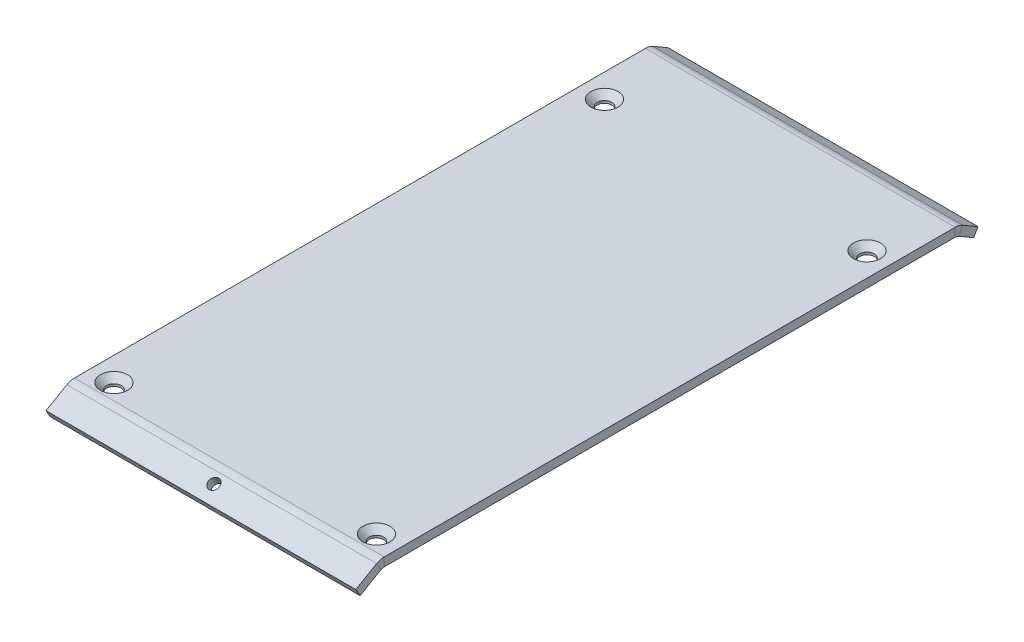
ISO-10303-21;
HEADER;
FILE_DESCRIPTION(('STEP AP214'),'2;1');
FILE_NAME('part.step','',(''),(''),'','','');
FILE_SCHEMA(('AUTOMOTIVE_DESIGN { 1 0 10303 214 1 1 1 1 }'));
ENDSEC;
DATA;
#1=APPLICATION_CONTEXT('core data for automotive mechanical design processes');
#2=APPLICATION_PROTOCOL_DEFINITION('international standard','automotive_design',2000,#1);
#3=PRODUCT_CONTEXT('',#1,'mechanical');
#4=PRODUCT('Part','Part','',(#3));
#5=PRODUCT_RELATED_PRODUCT_CATEGORY('part','',(#4));
#6=PRODUCT_DEFINITION_FORMATION('','',#4);
#7=PRODUCT_DEFINITION_CONTEXT('part definition',#1,'design');
#8=PRODUCT_DEFINITION('design','',#6,#7);
#9=PRODUCT_DEFINITION_SHAPE('','',#8);
#10=(LENGTH_UNIT() NAMED_UNIT(*) SI_UNIT(.MILLI.,.METRE.));
#11=(NAMED_UNIT(*) PLANE_ANGLE_UNIT() SI_UNIT($,.RADIAN.));
#12=(NAMED_UNIT(*) SI_UNIT($,.STERADIAN.) SOLID_ANGLE_UNIT());
#13=UNCERTAINTY_MEASURE_WITH_UNIT(LENGTH_MEASURE(1.E-05),#10,'distance_accuracy_value','');
#14=(GEOMETRIC_REPRESENTATION_CONTEXT(3) GLOBAL_UNCERTAINTY_ASSIGNED_CONTEXT((#13)) GLOBAL_UNIT_ASSIGNED_CONTEXT((#10,
#11,#12)) REPRESENTATION_CONTEXT('',''));
#15=CARTESIAN_POINT('',(0.,0.,0.));
#16=DIRECTION('',(0.,0.,1.));
#17=DIRECTION('',(1.,0.,0.));
#18=AXIS2_PLACEMENT_3D('',#15,#16,#17);
#19=CARTESIAN_POINT('',(36.,2.79903810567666,-4.84807621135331));
#20=DIRECTION('',(1.,0.,0.));
#21=DIRECTION('',(0.,0.,-1.));
#22=AXIS2_PLACEMENT_3D('',#19,#20,#21);
#23=PLANE('',#22);
#24=DIRECTION('',(0.,0.866025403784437,0.500000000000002));
#25=VECTOR('',#24,1.);
#26=CARTESIAN_POINT('',(36.,2.79903810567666,-4.84807621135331));
#27=LINE('',#26,#25);
#28=CARTESIAN_POINT('',(36.,2.79903810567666,-4.84807621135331));
#29=VERTEX_POINT('',#28);
#30=CARTESIAN_POINT('',(36.,4.53108891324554,-3.8480762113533));
#31=VERTEX_POINT('',#30);
#32=EDGE_CURVE('E11',#29,#31,#27,.T.);
#33=ORIENTED_EDGE('',*,*,#32,.F.);
#34=CARTESIAN_POINT('',(36.,1.50000000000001,-5.59807621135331));
#35=DIRECTION('',(1.,0.,0.));
#36=DIRECTION('',(0.,0.,-1.));
#37=AXIS2_PLACEMENT_3D('',#34,#35,#36);
#38=CIRCLE('',#37,1.5);
#39=CARTESIAN_POINT('',(36.,3.00000000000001,-5.59807621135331));
#40=VERTEX_POINT('',#39);
#41=EDGE_CURVE('E147',#29,#40,#38,.F.);
#42=ORIENTED_EDGE('',*,*,#41,.T.);
#43=DIRECTION('',(0.,-1.,0.));
#44=VECTOR('',#43,1.);
#45=CARTESIAN_POINT('',(36.,5.00000000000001,-5.59807621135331));
#46=LINE('',#45,#44);
#47=CARTESIAN_POINT('',(36.,5.00000000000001,-5.59807621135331));
#48=VERTEX_POINT('',#47);
#49=EDGE_CURVE('E43',#48,#40,#46,.T.);
#50=ORIENTED_EDGE('',*,*,#49,.F.);
#51=CARTESIAN_POINT('',(36.,1.50000000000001,-5.59807621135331));
#52=DIRECTION('',(1.,0.,0.));
#53=DIRECTION('',(0.,0.,-1.));
#54=AXIS2_PLACEMENT_3D('',#51,#52,#53);
#55=CIRCLE('',#54,3.5);
#56=EDGE_CURVE('E286',#31,#48,#55,.F.);
#57=ORIENTED_EDGE('',*,*,#56,.F.);
#58=EDGE_LOOP('',(#33,#42,#50,#57));
#59=FACE_BOUND('',#58,.T.);
#60=ADVANCED_FACE('F34',(#59),#23,.T.);
#61=CARTESIAN_POINT('',(36.,5.00000000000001,-5.59807621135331));
#62=DIRECTION('',(1.,0.,0.));
#63=DIRECTION('',(0.,0.,-1.));
#64=AXIS2_PLACEMENT_3D('',#61,#62,#63);
#65=PLANE('',#64);
#66=DIRECTION('',(0.,0.500000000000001,-0.866025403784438));
#67=VECTOR('',#66,1.);
#68=CARTESIAN_POINT('',(36.,0.,0.));
#69=LINE('',#68,#67);
#70=CARTESIAN_POINT('',(36.,0.,0.));
#71=VERTEX_POINT('',#70);
#72=EDGE_CURVE('E152',#71,#29,#69,.T.);
#73=ORIENTED_EDGE('',*,*,#72,.T.);
#74=ORIENTED_EDGE('',*,*,#32,.T.);
#75=DIRECTION('',(0.,0.500000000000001,-0.866025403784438));
#76=VECTOR('',#75,1.);
#77=CARTESIAN_POINT('',(36.,1.73205080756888,1.));
#78=LINE('',#77,#76);
#79=CARTESIAN_POINT('',(36.,1.73205080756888,1.));
#80=VERTEX_POINT('',#79);
#81=EDGE_CURVE('E288',#80,#31,#78,.T.);
#82=ORIENTED_EDGE('',*,*,#81,.F.);
#83=DIRECTION('',(0.,0.866025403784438,0.500000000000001));
#84=VECTOR('',#83,1.);
#85=CARTESIAN_POINT('',(36.,0.,0.));
#86=LINE('',#85,#84);
#87=EDGE_CURVE('E291',#71,#80,#86,.T.);
#88=ORIENTED_EDGE('',*,*,#87,.F.);
#89=EDGE_LOOP('',(#73,#74,#82,#88));
#90=FACE_BOUND('',#89,.T.);
#91=ADVANCED_FACE('F297',(#90),#65,.T.);
#92=CARTESIAN_POINT('',(-36.,3.00000000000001,-5.59807621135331));
#93=DIRECTION('',(-1.,0.,0.));
#94=DIRECTION('',(0.,0.,1.));
#95=AXIS2_PLACEMENT_3D('',#92,#93,#94);
#96=PLANE('',#95);
#97=DIRECTION('',(0.,1.,0.));
#98=VECTOR('',#97,1.);
#99=CARTESIAN_POINT('',(-36.,3.00000000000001,-5.59807621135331));
#100=LINE('',#99,#98);
#101=CARTESIAN_POINT('',(-36.,3.00000000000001,-5.59807621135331));
#102=VERTEX_POINT('',#101);
#103=CARTESIAN_POINT('',(-36.,5.00000000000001,-5.59807621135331));
#104=VERTEX_POINT('',#103);
#105=EDGE_CURVE('E144',#102,#104,#100,.T.);
#106=ORIENTED_EDGE('',*,*,#105,.F.);
#107=CARTESIAN_POINT('',(-36.,1.50000000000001,-5.59807621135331));
#108=DIRECTION('',(1.,0.,0.));
#109=DIRECTION('',(0.,0.,-1.));
#110=AXIS2_PLACEMENT_3D('',#107,#108,#109);
#111=CIRCLE('',#110,1.5);
#112=CARTESIAN_POINT('',(-36.,2.79903810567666,-4.84807621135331));
#113=VERTEX_POINT('',#112);
#114=EDGE_CURVE('E159',#113,#102,#111,.F.);
#115=ORIENTED_EDGE('',*,*,#114,.F.);
#116=DIRECTION('',(0.,-0.866025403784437,-0.500000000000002));
#117=VECTOR('',#116,1.);
#118=CARTESIAN_POINT('',(-36.,4.53108891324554,-3.8480762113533));
#119=LINE('',#118,#117);
#120=CARTESIAN_POINT('',(-36.,4.53108891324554,-3.8480762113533));
#121=VERTEX_POINT('',#120);
#122=EDGE_CURVE('E233',#121,#113,#119,.T.);
#123=ORIENTED_EDGE('',*,*,#122,.F.);
#124=CARTESIAN_POINT('',(-36.,1.50000000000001,-5.59807621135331));
#125=DIRECTION('',(1.,0.,0.));
#126=DIRECTION('',(0.,0.,-1.));
#127=AXIS2_PLACEMENT_3D('',#124,#125,#126);
#128=CIRCLE('',#127,3.5);
#129=EDGE_CURVE('E187',#121,#104,#128,.F.);
#130=ORIENTED_EDGE('',*,*,#129,.T.);
#131=EDGE_LOOP('',(#106,#115,#123,#130));
#132=FACE_BOUND('',#131,.T.);
#133=ADVANCED_FACE('F304',(#132),#96,.T.);
#134=CARTESIAN_POINT('',(-36.,4.53108891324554,-3.8480762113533));
#135=DIRECTION('',(-1.,0.,0.));
#136=DIRECTION('',(0.,0.,1.));
#137=AXIS2_PLACEMENT_3D('',#134,#135,#136);
#138=PLANE('',#137);
#139=DIRECTION('',(0.,0.,-1.));
#140=VECTOR('',#139,1.);
#141=CARTESIAN_POINT('',(-36.,3.00000000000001,-5.19615242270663));
#142=LINE('',#141,#140);
#143=CARTESIAN_POINT('',(-36.,3.00000000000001,-138.29422863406));
#144=VERTEX_POINT('',#143);
#145=EDGE_CURVE('E200',#102,#144,#142,.T.);
#146=ORIENTED_EDGE('',*,*,#145,.F.);
#147=ORIENTED_EDGE('',*,*,#105,.T.);
#148=DIRECTION('',(0.,0.,-1.));
#149=VECTOR('',#148,1.);
#150=CARTESIAN_POINT('',(-36.,5.00000000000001,-5.19615242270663));
#151=LINE('',#150,#149);
#152=CARTESIAN_POINT('',(-36.,5.00000000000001,-138.29422863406));
#153=VERTEX_POINT('',#152);
#154=EDGE_CURVE('E185',#104,#153,#151,.T.);
#155=ORIENTED_EDGE('',*,*,#154,.T.);
#156=DIRECTION('',(0.,-1.,0.));
#157=VECTOR('',#156,1.);
#158=CARTESIAN_POINT('',(-36.,5.00000000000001,-138.29422863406));
#159=LINE('',#158,#157);
#160=EDGE_CURVE('E93',#153,#144,#159,.T.);
#161=ORIENTED_EDGE('',*,*,#160,.T.);
#162=EDGE_LOOP('',(#146,#147,#155,#161));
#163=FACE_BOUND('',#162,.T.);
#164=ADVANCED_FACE('F306',(#163),#138,.T.);
#165=CARTESIAN_POINT('',(36.,3.00000000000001,-138.29422863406));
#166=DIRECTION('',(1.,0.,0.));
#167=DIRECTION('',(0.,0.,-1.));
#168=AXIS2_PLACEMENT_3D('',#165,#166,#167);
#169=PLANE('',#168);
#170=DIRECTION('',(0.,1.,0.));
#171=VECTOR('',#170,1.);
#172=CARTESIAN_POINT('',(36.,3.00000000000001,-138.29422863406));
#173=LINE('',#172,#171);
#174=CARTESIAN_POINT('',(36.,3.00000000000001,-138.29422863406));
#175=VERTEX_POINT('',#174);
#176=CARTESIAN_POINT('',(36.,5.00000000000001,-138.29422863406));
#177=VERTEX_POINT('',#176);
#178=EDGE_CURVE('E231',#175,#177,#173,.T.);
#179=ORIENTED_EDGE('',*,*,#178,.F.);
#180=CARTESIAN_POINT('',(36.,1.50000000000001,-138.29422863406));
#181=DIRECTION('',(1.,0.,0.));
#182=DIRECTION('',(0.,0.,-1.));
#183=AXIS2_PLACEMENT_3D('',#180,#181,#182);
#184=CIRCLE('',#183,1.5);
#185=CARTESIAN_POINT('',(36.,2.79903810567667,-139.04422863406));
#186=VERTEX_POINT('',#185);
#187=EDGE_CURVE('E167',#175,#186,#184,.F.);
#188=ORIENTED_EDGE('',*,*,#187,.T.);
#189=DIRECTION('',(0.,-0.866025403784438,0.500000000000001));
#190=VECTOR('',#189,1.);
#191=CARTESIAN_POINT('',(36.,4.53108891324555,-140.04422863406));
#192=LINE('',#191,#190);
#193=CARTESIAN_POINT('',(36.,4.53108891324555,-140.04422863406));
#194=VERTEX_POINT('',#193);
#195=EDGE_CURVE('E52',#194,#186,#192,.T.);
#196=ORIENTED_EDGE('',*,*,#195,.F.);
#197=CARTESIAN_POINT('',(36.,1.50000000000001,-138.29422863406));
#198=DIRECTION('',(1.,0.,0.));
#199=DIRECTION('',(0.,0.,-1.));
#200=AXIS2_PLACEMENT_3D('',#197,#198,#199);
#201=CIRCLE('',#200,3.5);
#202=EDGE_CURVE('E282',#177,#194,#201,.F.);
#203=ORIENTED_EDGE('',*,*,#202,.F.);
#204=EDGE_LOOP('',(#179,#188,#196,#203));
#205=FACE_BOUND('',#204,.T.);
#206=ADVANCED_FACE('F353',(#205),#169,.T.);
#207=CARTESIAN_POINT('',(36.,4.53108891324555,-140.04422863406));
#208=DIRECTION('',(1.,0.,0.));
#209=DIRECTION('',(0.,0.,-1.));
#210=AXIS2_PLACEMENT_3D('',#207,#208,#209);
#211=PLANE('',#210);
#212=DIRECTION('',(0.,0.,-1.));
#213=VECTOR('',#212,1.);
#214=CARTESIAN_POINT('',(36.,3.00000000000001,-5.19615242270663));
#215=LINE('',#214,#213);
#216=EDGE_CURVE('E136',#40,#175,#215,.T.);
#217=ORIENTED_EDGE('',*,*,#216,.T.);
#218=ORIENTED_EDGE('',*,*,#178,.T.);
#219=DIRECTION('',(0.,0.,-1.));
#220=VECTOR('',#219,1.);
#221=CARTESIAN_POINT('',(36.,5.00000000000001,-5.19615242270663));
#222=LINE('',#221,#220);
#223=EDGE_CURVE('E139',#48,#177,#222,.T.);
#224=ORIENTED_EDGE('',*,*,#223,.F.);
#225=ORIENTED_EDGE('',*,*,#49,.T.);
#226=EDGE_LOOP('',(#217,#218,#224,#225));
#227=FACE_BOUND('',#226,.T.);
#228=ADVANCED_FACE('F134',(#227),#211,.T.);
#229=CARTESIAN_POINT('',(-36.,2.79903810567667,-139.04422863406));
#230=DIRECTION('',(-1.,0.,0.));
#231=DIRECTION('',(0.,0.,1.));
#232=AXIS2_PLACEMENT_3D('',#229,#230,#231);
#233=PLANE('',#232);
#234=DIRECTION('',(0.,0.866025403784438,-0.500000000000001));
#235=VECTOR('',#234,1.);
#236=CARTESIAN_POINT('',(-36.,2.79903810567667,-139.04422863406));
#237=LINE('',#236,#235);
#238=CARTESIAN_POINT('',(-36.,2.79903810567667,-139.04422863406));
#239=VERTEX_POINT('',#238);
#240=CARTESIAN_POINT('',(-36.,4.53108891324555,-140.04422863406));
#241=VERTEX_POINT('',#240);
#242=EDGE_CURVE('E100',#239,#241,#237,.T.);
#243=ORIENTED_EDGE('',*,*,#242,.F.);
#244=CARTESIAN_POINT('',(-36.,1.50000000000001,-138.29422863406));
#245=DIRECTION('',(1.,0.,0.));
#246=DIRECTION('',(0.,0.,-1.));
#247=AXIS2_PLACEMENT_3D('',#244,#245,#246);
#248=CIRCLE('',#247,1.5);
#249=EDGE_CURVE('E202',#144,#239,#248,.F.);
#250=ORIENTED_EDGE('',*,*,#249,.F.);
#251=ORIENTED_EDGE('',*,*,#160,.F.);
#252=CARTESIAN_POINT('',(-36.,1.50000000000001,-138.29422863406));
#253=DIRECTION('',(1.,0.,0.));
#254=DIRECTION('',(0.,0.,-1.));
#255=AXIS2_PLACEMENT_3D('',#252,#253,#254);
#256=CIRCLE('',#255,3.5);
#257=EDGE_CURVE('E183',#153,#241,#256,.F.);
#258=ORIENTED_EDGE('',*,*,#257,.T.);
#259=EDGE_LOOP('',(#243,#250,#251,#258));
#260=FACE_BOUND('',#259,.T.);
#261=ADVANCED_FACE('F319',(#260),#233,.T.);
#262=CARTESIAN_POINT('',(-36.,5.00000000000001,-138.29422863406));
#263=DIRECTION('',(-1.,0.,0.));
#264=DIRECTION('',(0.,0.,1.));
#265=AXIS2_PLACEMENT_3D('',#262,#263,#264);
#266=PLANE('',#265);
#267=DIRECTION('',(0.,-0.500000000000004,-0.866025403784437));
#268=VECTOR('',#267,1.);
#269=CARTESIAN_POINT('',(-36.,3.00000000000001,-138.696152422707));
#270=LINE('',#269,#268);
#271=CARTESIAN_POINT('',(-36.,0.749999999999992,-142.593266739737));
#272=VERTEX_POINT('',#271);
#273=EDGE_CURVE('E173',#239,#272,#270,.T.);
#274=ORIENTED_EDGE('',*,*,#273,.F.);
#275=ORIENTED_EDGE('',*,*,#242,.T.);
#276=DIRECTION('',(0.,-0.500000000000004,-0.866025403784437));
#277=VECTOR('',#276,1.);
#278=CARTESIAN_POINT('',(-36.,4.73205080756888,-139.696152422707));
#279=LINE('',#278,#277);
#280=CARTESIAN_POINT('',(-36.,2.48205080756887,-143.593266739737));
#281=VERTEX_POINT('',#280);
#282=EDGE_CURVE('E180',#241,#281,#279,.T.);
#283=ORIENTED_EDGE('',*,*,#282,.T.);
#284=DIRECTION('',(0.,-0.866025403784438,0.500000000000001));
#285=VECTOR('',#284,1.);
#286=CARTESIAN_POINT('',(-36.,2.48205080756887,-143.593266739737));
#287=LINE('',#286,#285);
#288=EDGE_CURVE('E176',#281,#272,#287,.T.);
#289=ORIENTED_EDGE('',*,*,#288,.T.);
#290=EDGE_LOOP('',(#274,#275,#283,#289));
#291=FACE_BOUND('',#290,.T.);
#292=ADVANCED_FACE('F327',(#291),#266,.T.);
#293=CARTESIAN_POINT('',(36.,3.00000000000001,-138.696152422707));
#294=DIRECTION('',(0.,0.866025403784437,-0.500000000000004));
#295=DIRECTION('',(0.,0.500000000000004,0.866025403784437));
#296=AXIS2_PLACEMENT_3D('',#293,#294,#295);
#297=PLANE('',#296);
#298=ORIENTED_EDGE('',*,*,#273,.T.);
#299=DIRECTION('',(-1.,0.,0.));
#300=VECTOR('',#299,1.);
#301=CARTESIAN_POINT('',(36.,0.749999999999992,-142.593266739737));
#302=LINE('',#301,#300);
#303=CARTESIAN_POINT('',(36.,0.749999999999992,-142.593266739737));
#304=VERTEX_POINT('',#303);
#305=EDGE_CURVE('E226',#304,#272,#302,.T.);
#306=ORIENTED_EDGE('',*,*,#305,.F.);
#307=DIRECTION('',(0.,-0.500000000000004,-0.866025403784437));
#308=VECTOR('',#307,1.);
#309=CARTESIAN_POINT('',(36.,3.00000000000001,-138.696152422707));
#310=LINE('',#309,#308);
#311=EDGE_CURVE('E106',#186,#304,#310,.T.);
#312=ORIENTED_EDGE('',*,*,#311,.F.);
#313=DIRECTION('',(-1.,0.,0.));
#314=VECTOR('',#313,1.);
#315=CARTESIAN_POINT('',(36.,2.79903810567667,-139.04422863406));
#316=LINE('',#315,#314);
#317=EDGE_CURVE('E169',#186,#239,#316,.T.);
#318=ORIENTED_EDGE('',*,*,#317,.T.);
#319=EDGE_LOOP('',(#298,#306,#312,#318));
#320=FACE_BOUND('',#319,.T.);
#321=ADVANCED_FACE('F325',(#320),#297,.F.);
#322=CARTESIAN_POINT('',(36.,2.48205080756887,-143.593266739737));
#323=DIRECTION('',(0.,-0.500000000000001,-0.866025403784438));
#324=DIRECTION('',(0.,0.866025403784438,-0.500000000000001));
#325=AXIS2_PLACEMENT_3D('',#322,#323,#324);
#326=PLANE('',#325);
#327=ORIENTED_EDGE('',*,*,#288,.F.);
#328=DIRECTION('',(-1.,0.,0.));
#329=VECTOR('',#328,1.);
#330=CARTESIAN_POINT('',(36.,2.48205080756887,-143.593266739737));
#331=LINE('',#330,#329);
#332=CARTESIAN_POINT('',(36.,2.48205080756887,-143.593266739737));
#333=VERTEX_POINT('',#332);
#334=EDGE_CURVE('E224',#333,#281,#331,.T.);
#335=ORIENTED_EDGE('',*,*,#334,.F.);
#336=DIRECTION('',(0.,-0.866025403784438,0.500000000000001));
#337=VECTOR('',#336,1.);
#338=CARTESIAN_POINT('',(36.,2.48205080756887,-143.593266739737));
#339=LINE('',#338,#337);
#340=EDGE_CURVE('E276',#333,#304,#339,.T.);
#341=ORIENTED_EDGE('',*,*,#340,.T.);
#342=ORIENTED_EDGE('',*,*,#305,.T.);
#343=EDGE_LOOP('',(#327,#335,#341,#342));
#344=FACE_BOUND('',#343,.T.);
#345=ADVANCED_FACE('F330',(#344),#326,.T.);
#346=CARTESIAN_POINT('',(36.,4.73205080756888,-139.696152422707));
#347=DIRECTION('',(0.,0.866025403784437,-0.500000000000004));
#348=DIRECTION('',(0.,0.500000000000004,0.866025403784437));
#349=AXIS2_PLACEMENT_3D('',#346,#347,#348);
#350=PLANE('',#349);
#351=ORIENTED_EDGE('',*,*,#282,.F.);
#352=DIRECTION('',(-1.,0.,0.));
#353=VECTOR('',#352,1.);
#354=CARTESIAN_POINT('',(36.,4.53108891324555,-140.04422863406));
#355=LINE('',#354,#353);
#356=EDGE_CURVE('E221',#194,#241,#355,.T.);
#357=ORIENTED_EDGE('',*,*,#356,.F.);
#358=DIRECTION('',(0.,-0.500000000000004,-0.866025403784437));
#359=VECTOR('',#358,1.);
#360=CARTESIAN_POINT('',(36.,4.73205080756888,-139.696152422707));
#361=LINE('',#360,#359);
#362=EDGE_CURVE('E279',#194,#333,#361,.T.);
#363=ORIENTED_EDGE('',*,*,#362,.T.);
#364=ORIENTED_EDGE('',*,*,#334,.T.);
#365=EDGE_LOOP('',(#351,#357,#363,#364));
#366=FACE_BOUND('',#365,.T.);
#367=ADVANCED_FACE('F333',(#366),#350,.T.);
#368=CARTESIAN_POINT('',(36.,1.50000000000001,-138.29422863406));
#369=DIRECTION('',(-1.,0.,0.));
#370=DIRECTION('',(0.,0.,1.));
#371=AXIS2_PLACEMENT_3D('',#368,#369,#370);
#372=CYLINDRICAL_SURFACE('',#371,3.5);
#373=ORIENTED_EDGE('',*,*,#257,.F.);
#374=DIRECTION('',(-1.,0.,0.));
#375=VECTOR('',#374,1.);
#376=CARTESIAN_POINT('',(36.,5.00000000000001,-138.29422863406));
#377=LINE('',#376,#375);
#378=EDGE_CURVE('E218',#177,#153,#377,.T.);
#379=ORIENTED_EDGE('',*,*,#378,.F.);
#380=ORIENTED_EDGE('',*,*,#202,.T.);
#381=ORIENTED_EDGE('',*,*,#356,.T.);
#382=EDGE_LOOP('',(#373,#379,#380,#381));
#383=FACE_BOUND('',#382,.T.);
#384=ADVANCED_FACE('F316',(#383),#372,.T.);
#385=CARTESIAN_POINT('',(36.,5.00000000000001,-5.19615242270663));
#386=DIRECTION('',(0.,1.,0.));
#387=DIRECTION('',(0.,0.,1.));
#388=AXIS2_PLACEMENT_3D('',#385,#386,#387);
#389=PLANE('',#388);
#390=CARTESIAN_POINT('',(30.5,5.00000000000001,-9.29422863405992));
#391=DIRECTION('',(0.,1.,0.));
#392=DIRECTION('',(0.,0.,1.));
#393=AXIS2_PLACEMENT_3D('',#390,#391,#392);
#394=CIRCLE('',#393,3.15);
#395=CARTESIAN_POINT('',(30.5,5.00000000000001,-6.14422863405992));
#396=VERTEX_POINT('',#395);
#397=EDGE_CURVE('E257',#396,#396,#394,.T.);
#398=ORIENTED_EDGE('',*,*,#397,.F.);
#399=EDGE_LOOP('',(#398));
#400=FACE_BOUND('',#399,.T.);
#401=CARTESIAN_POINT('',(30.5,5.00000000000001,-123.29422863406));
#402=DIRECTION('',(0.,1.,0.));
#403=DIRECTION('',(0.,0.,1.));
#404=AXIS2_PLACEMENT_3D('',#401,#402,#403);
#405=CIRCLE('',#404,3.15);
#406=CARTESIAN_POINT('',(30.5,5.00000000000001,-120.14422863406));
#407=VERTEX_POINT('',#406);
#408=EDGE_CURVE('E250',#407,#407,#405,.T.);
#409=ORIENTED_EDGE('',*,*,#408,.F.);
#410=EDGE_LOOP('',(#409));
#411=FACE_BOUND('',#410,.T.);
#412=CARTESIAN_POINT('',(-30.5,5.00000000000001,-123.29422863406));
#413=DIRECTION('',(0.,1.,0.));
#414=DIRECTION('',(0.,0.,1.));
#415=AXIS2_PLACEMENT_3D('',#412,#413,#414);
#416=CIRCLE('',#415,3.15);
#417=CARTESIAN_POINT('',(-30.5,5.00000000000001,-120.14422863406));
#418=VERTEX_POINT('',#417);
#419=EDGE_CURVE('E246',#418,#418,#416,.T.);
#420=ORIENTED_EDGE('',*,*,#419,.F.);
#421=EDGE_LOOP('',(#420));
#422=FACE_BOUND('',#421,.T.);
#423=CARTESIAN_POINT('',(-30.5,5.00000000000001,-9.29422863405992));
#424=DIRECTION('',(0.,1.,0.));
#425=DIRECTION('',(0.,0.,1.));
#426=AXIS2_PLACEMENT_3D('',#423,#424,#425);
#427=CIRCLE('',#426,3.15);
#428=CARTESIAN_POINT('',(-30.5,5.00000000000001,-6.14422863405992));
#429=VERTEX_POINT('',#428);
#430=EDGE_CURVE('E242',#429,#429,#427,.T.);
#431=ORIENTED_EDGE('',*,*,#430,.F.);
#432=EDGE_LOOP('',(#431));
#433=FACE_BOUND('',#432,.T.);
#434=ORIENTED_EDGE('',*,*,#154,.F.);
#435=DIRECTION('',(-1.,0.,0.));
#436=VECTOR('',#435,1.);
#437=CARTESIAN_POINT('',(36.,5.00000000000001,-5.59807621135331));
#438=LINE('',#437,#436);
#439=EDGE_CURVE('E215',#48,#104,#438,.T.);
#440=ORIENTED_EDGE('',*,*,#439,.F.);
#441=ORIENTED_EDGE('',*,*,#223,.T.);
#442=ORIENTED_EDGE('',*,*,#378,.T.);
#443=EDGE_LOOP('',(#434,#440,#441,#442));
#444=FACE_BOUND('',#443,.T.);
#445=ADVANCED_FACE('F311',(#400,#411,#422,#433,#444),#389,.T.);
#446=CARTESIAN_POINT('',(36.,1.50000000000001,-5.59807621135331));
#447=DIRECTION('',(-1.,0.,0.));
#448=DIRECTION('',(0.,0.,1.));
#449=AXIS2_PLACEMENT_3D('',#446,#447,#448);
#450=CYLINDRICAL_SURFACE('',#449,3.5);
#451=ORIENTED_EDGE('',*,*,#129,.F.);
#452=DIRECTION('',(-1.,0.,0.));
#453=VECTOR('',#452,1.);
#454=CARTESIAN_POINT('',(36.,4.53108891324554,-3.8480762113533));
#455=LINE('',#454,#453);
#456=EDGE_CURVE('E212',#31,#121,#455,.T.);
#457=ORIENTED_EDGE('',*,*,#456,.F.);
#458=ORIENTED_EDGE('',*,*,#56,.T.);
#459=ORIENTED_EDGE('',*,*,#439,.T.);
#460=EDGE_LOOP('',(#451,#457,#458,#459));
#461=FACE_BOUND('',#460,.T.);
#462=ADVANCED_FACE('F309',(#461),#450,.T.);
#463=CARTESIAN_POINT('',(36.,1.73205080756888,1.));
#464=DIRECTION('',(0.,0.866025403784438,0.500000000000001));
#465=DIRECTION('',(0.,-0.500000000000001,0.866025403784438));
#466=AXIS2_PLACEMENT_3D('',#463,#464,#465);
#467=PLANE('',#466);
#468=CARTESIAN_POINT('',(0.,3.48205080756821,-2.03108891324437));
#469=DIRECTION('',(0.,0.866025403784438,0.500000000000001));
#470=DIRECTION('',(0.,-0.500000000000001,0.866025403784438));
#471=AXIS2_PLACEMENT_3D('',#468,#469,#470);
#472=CIRCLE('',#471,1.24999999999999);
#473=CARTESIAN_POINT('',(0.,2.85705080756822,-0.948557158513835));
#474=VERTEX_POINT('',#473);
#475=EDGE_CURVE('E579',#474,#474,#472,.T.);
#476=ORIENTED_EDGE('',*,*,#475,.F.);
#477=EDGE_LOOP('',(#476));
#478=FACE_BOUND('',#477,.T.);
#479=DIRECTION('',(0.,0.500000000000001,-0.866025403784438));
#480=VECTOR('',#479,1.);
#481=CARTESIAN_POINT('',(-36.,1.73205080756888,1.));
#482=LINE('',#481,#480);
#483=CARTESIAN_POINT('',(-36.,1.73205080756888,1.));
#484=VERTEX_POINT('',#483);
#485=EDGE_CURVE('E190',#484,#121,#482,.T.);
#486=ORIENTED_EDGE('',*,*,#485,.F.);
#487=DIRECTION('',(-1.,0.,0.));
#488=VECTOR('',#487,1.);
#489=CARTESIAN_POINT('',(36.,1.73205080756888,1.));
#490=LINE('',#489,#488);
#491=EDGE_CURVE('E210',#80,#484,#490,.T.);
#492=ORIENTED_EDGE('',*,*,#491,.F.);
#493=ORIENTED_EDGE('',*,*,#81,.T.);
#494=ORIENTED_EDGE('',*,*,#456,.T.);
#495=EDGE_LOOP('',(#486,#492,#493,#494));
#496=FACE_BOUND('',#495,.T.);
#497=ADVANCED_FACE('F396',(#478,#496),#467,.T.);
#498=CARTESIAN_POINT('',(36.,0.,0.));
#499=DIRECTION('',(0.,-0.500000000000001,0.866025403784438));
#500=DIRECTION('',(0.,-0.866025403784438,-0.500000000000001));
#501=AXIS2_PLACEMENT_3D('',#498,#499,#500);
#502=PLANE('',#501);
#503=DIRECTION('',(0.,0.866025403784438,0.500000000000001));
#504=VECTOR('',#503,1.);
#505=CARTESIAN_POINT('',(-36.,0.,0.));
#506=LINE('',#505,#504);
#507=CARTESIAN_POINT('',(-36.,0.,0.));
#508=VERTEX_POINT('',#507);
#509=EDGE_CURVE('E193',#508,#484,#506,.T.);
#510=ORIENTED_EDGE('',*,*,#509,.F.);
#511=DIRECTION('',(-1.,0.,0.));
#512=VECTOR('',#511,1.);
#513=CARTESIAN_POINT('',(36.,0.,0.));
#514=LINE('',#513,#512);
#515=EDGE_CURVE('E208',#71,#508,#514,.T.);
#516=ORIENTED_EDGE('',*,*,#515,.F.);
#517=ORIENTED_EDGE('',*,*,#87,.T.);
#518=ORIENTED_EDGE('',*,*,#491,.T.);
#519=EDGE_LOOP('',(#510,#516,#517,#518));
#520=FACE_BOUND('',#519,.T.);
#521=ADVANCED_FACE('F404',(#520),#502,.T.);
#522=CARTESIAN_POINT('',(36.,0.,0.));
#523=DIRECTION('',(0.,0.866025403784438,0.500000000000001));
#524=DIRECTION('',(0.,-0.500000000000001,0.866025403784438));
#525=AXIS2_PLACEMENT_3D('',#522,#523,#524);
#526=PLANE('',#525);
#527=CARTESIAN_POINT('',(0.,1.74999999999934,-3.03108891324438));
#528=DIRECTION('',(0.,0.866025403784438,0.500000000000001));
#529=DIRECTION('',(0.,-0.500000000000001,0.866025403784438));
#530=AXIS2_PLACEMENT_3D('',#527,#528,#529);
#531=CIRCLE('',#530,1.24999999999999);
#532=CARTESIAN_POINT('',(0.,1.12499999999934,-1.94855715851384));
#533=VERTEX_POINT('',#532);
#534=EDGE_CURVE('E37',#533,#533,#531,.T.);
#535=ORIENTED_EDGE('',*,*,#534,.T.);
#536=EDGE_LOOP('',(#535));
#537=FACE_BOUND('',#536,.T.);
#538=DIRECTION('',(0.,0.500000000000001,-0.866025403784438));
#539=VECTOR('',#538,1.);
#540=CARTESIAN_POINT('',(-36.,0.,0.));
#541=LINE('',#540,#539);
#542=EDGE_CURVE('E196',#508,#113,#541,.T.);
#543=ORIENTED_EDGE('',*,*,#542,.T.);
#544=DIRECTION('',(-1.,0.,0.));
#545=VECTOR('',#544,1.);
#546=CARTESIAN_POINT('',(36.,2.79903810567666,-4.84807621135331));
#547=LINE('',#546,#545);
#548=EDGE_CURVE('E161',#29,#113,#547,.T.);
#549=ORIENTED_EDGE('',*,*,#548,.F.);
#550=ORIENTED_EDGE('',*,*,#72,.F.);
#551=ORIENTED_EDGE('',*,*,#515,.T.);
#552=EDGE_LOOP('',(#543,#549,#550,#551));
#553=FACE_BOUND('',#552,.T.);
#554=ADVANCED_FACE('F301',(#537,#553),#526,.F.);
#555=CARTESIAN_POINT('',(36.,1.50000000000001,-5.59807621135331));
#556=DIRECTION('',(-1.,0.,0.));
#557=DIRECTION('',(0.,0.,1.));
#558=AXIS2_PLACEMENT_3D('',#555,#556,#557);
#559=CYLINDRICAL_SURFACE('',#558,1.5);
#560=ORIENTED_EDGE('',*,*,#114,.T.);
#561=DIRECTION('',(-1.,0.,0.));
#562=VECTOR('',#561,1.);
#563=CARTESIAN_POINT('',(36.,3.00000000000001,-5.59807621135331));
#564=LINE('',#563,#562);
#565=EDGE_CURVE('E156',#40,#102,#564,.T.);
#566=ORIENTED_EDGE('',*,*,#565,.F.);
#567=ORIENTED_EDGE('',*,*,#41,.F.);
#568=ORIENTED_EDGE('',*,*,#548,.T.);
#569=EDGE_LOOP('',(#560,#566,#567,#568));
#570=FACE_BOUND('',#569,.T.);
#571=ADVANCED_FACE('F157',(#570),#559,.F.);
#572=CARTESIAN_POINT('',(36.,3.00000000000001,-5.19615242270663));
#573=DIRECTION('',(0.,1.,0.));
#574=DIRECTION('',(0.,0.,1.));
#575=AXIS2_PLACEMENT_3D('',#572,#573,#574);
#576=PLANE('',#575);
#577=CARTESIAN_POINT('',(30.5,3.00000000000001,-9.29422863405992));
#578=DIRECTION('',(0.,1.,0.));
#579=DIRECTION('',(0.,0.,1.));
#580=AXIS2_PLACEMENT_3D('',#577,#578,#579);
#581=CIRCLE('',#580,1.69999999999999);
#582=CARTESIAN_POINT('',(30.5,3.00000000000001,-7.59422863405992));
#583=VERTEX_POINT('',#582);
#584=EDGE_CURVE('E248',#583,#583,#581,.T.);
#585=ORIENTED_EDGE('',*,*,#584,.T.);
#586=EDGE_LOOP('',(#585));
#587=FACE_BOUND('',#586,.T.);
#588=CARTESIAN_POINT('',(30.5,3.00000000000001,-123.29422863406));
#589=DIRECTION('',(0.,1.,0.));
#590=DIRECTION('',(0.,0.,1.));
#591=AXIS2_PLACEMENT_3D('',#588,#589,#590);
#592=CIRCLE('',#591,1.69999999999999);
#593=CARTESIAN_POINT('',(30.5,3.00000000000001,-121.59422863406));
#594=VERTEX_POINT('',#593);
#595=EDGE_CURVE('E244',#594,#594,#592,.T.);
#596=ORIENTED_EDGE('',*,*,#595,.T.);
#597=EDGE_LOOP('',(#596));
#598=FACE_BOUND('',#597,.T.);
#599=CARTESIAN_POINT('',(-30.5,3.00000000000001,-123.29422863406));
#600=DIRECTION('',(0.,1.,0.));
#601=DIRECTION('',(0.,0.,1.));
#602=AXIS2_PLACEMENT_3D('',#599,#600,#601);
#603=CIRCLE('',#602,1.69999999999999);
#604=CARTESIAN_POINT('',(-30.5,3.00000000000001,-121.59422863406));
#605=VERTEX_POINT('',#604);
#606=EDGE_CURVE('E239',#605,#605,#603,.T.);
#607=ORIENTED_EDGE('',*,*,#606,.T.);
#608=EDGE_LOOP('',(#607));
#609=FACE_BOUND('',#608,.T.);
#610=CARTESIAN_POINT('',(-30.5,3.00000000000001,-9.29422863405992));
#611=DIRECTION('',(0.,1.,0.));
#612=DIRECTION('',(0.,0.,1.));
#613=AXIS2_PLACEMENT_3D('',#610,#611,#612);
#614=CIRCLE('',#613,1.69999999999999);
#615=CARTESIAN_POINT('',(-30.5,3.00000000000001,-7.59422863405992));
#616=VERTEX_POINT('',#615);
#617=EDGE_CURVE('E177',#616,#616,#614,.T.);
#618=ORIENTED_EDGE('',*,*,#617,.T.);
#619=EDGE_LOOP('',(#618));
#620=FACE_BOUND('',#619,.T.);
#621=ORIENTED_EDGE('',*,*,#145,.T.);
#622=DIRECTION('',(-1.,0.,0.));
#623=VECTOR('',#622,1.);
#624=CARTESIAN_POINT('',(36.,3.00000000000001,-138.29422863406));
#625=LINE('',#624,#623);
#626=EDGE_CURVE('E162',#175,#144,#625,.T.);
#627=ORIENTED_EDGE('',*,*,#626,.F.);
#628=ORIENTED_EDGE('',*,*,#216,.F.);
#629=ORIENTED_EDGE('',*,*,#565,.T.);
#630=EDGE_LOOP('',(#621,#627,#628,#629));
#631=FACE_BOUND('',#630,.T.);
#632=ADVANCED_FACE('F164',(#587,#598,#609,#620,#631),#576,.F.);
#633=CARTESIAN_POINT('',(36.,1.50000000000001,-138.29422863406));
#634=DIRECTION('',(-1.,0.,0.));
#635=DIRECTION('',(0.,0.,1.));
#636=AXIS2_PLACEMENT_3D('',#633,#634,#635);
#637=CYLINDRICAL_SURFACE('',#636,1.5);
#638=ORIENTED_EDGE('',*,*,#249,.T.);
#639=ORIENTED_EDGE('',*,*,#317,.F.);
#640=ORIENTED_EDGE('',*,*,#187,.F.);
#641=ORIENTED_EDGE('',*,*,#626,.T.);
#642=EDGE_LOOP('',(#638,#639,#640,#641));
#643=FACE_BOUND('',#642,.T.);
#644=ADVANCED_FACE('F322',(#643),#637,.F.);
#645=CARTESIAN_POINT('',(36.,1.50000000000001,-138.29422863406));
#646=DIRECTION('',(1.,0.,0.));
#647=DIRECTION('',(0.,0.,-1.));
#648=AXIS2_PLACEMENT_3D('',#645,#646,#647);
#649=PLANE('',#648);
#650=ORIENTED_EDGE('',*,*,#311,.T.);
#651=ORIENTED_EDGE('',*,*,#340,.F.);
#652=ORIENTED_EDGE('',*,*,#362,.F.);
#653=ORIENTED_EDGE('',*,*,#195,.T.);
#654=EDGE_LOOP('',(#650,#651,#652,#653));
#655=FACE_BOUND('',#654,.T.);
#656=ADVANCED_FACE('F331',(#655),#649,.T.);
#657=CARTESIAN_POINT('',(-36.,1.50000000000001,-138.29422863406));
#658=DIRECTION('',(1.,0.,0.));
#659=DIRECTION('',(0.,0.,-1.));
#660=AXIS2_PLACEMENT_3D('',#657,#658,#659);
#661=PLANE('',#660);
#662=ORIENTED_EDGE('',*,*,#485,.T.);
#663=ORIENTED_EDGE('',*,*,#122,.T.);
#664=ORIENTED_EDGE('',*,*,#542,.F.);
#665=ORIENTED_EDGE('',*,*,#509,.T.);
#666=EDGE_LOOP('',(#662,#663,#664,#665));
#667=FACE_BOUND('',#666,.T.);
#668=ADVANCED_FACE('F441',(#667),#661,.F.);
#669=CARTESIAN_POINT('',(-30.5,5.00000000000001,-9.29422863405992));
#670=DIRECTION('',(0.,1.,0.));
#671=DIRECTION('',(0.,0.,1.));
#672=AXIS2_PLACEMENT_3D('',#669,#670,#671);
#673=CYLINDRICAL_SURFACE('',#672,1.69999999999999);
#674=CARTESIAN_POINT('',(-30.5,3.55,-9.29422863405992));
#675=DIRECTION('',(0.,1.,0.));
#676=DIRECTION('',(0.,0.,1.));
#677=AXIS2_PLACEMENT_3D('',#674,#675,#676);
#678=CIRCLE('',#677,1.69999999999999);
#679=CARTESIAN_POINT('',(-30.5,3.55,-7.59422863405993));
#680=VERTEX_POINT('',#679);
#681=EDGE_CURVE('E238',#680,#680,#678,.T.);
#682=ORIENTED_EDGE('',*,*,#681,.T.);
#683=EDGE_LOOP('',(#682));
#684=FACE_BOUND('',#683,.T.);
#685=ORIENTED_EDGE('',*,*,#617,.F.);
#686=EDGE_LOOP('',(#685));
#687=FACE_BOUND('',#686,.T.);
#688=ADVANCED_FACE('F451',(#684,#687),#673,.F.);
#689=CARTESIAN_POINT('',(-30.5,5.00000000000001,-9.29422863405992));
#690=DIRECTION('',(0.,1.,0.));
#691=DIRECTION('',(0.,0.,1.));
#692=AXIS2_PLACEMENT_3D('',#689,#690,#691);
#693=CONICAL_SURFACE('',#692,3.15,0.78539816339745);
#694=ORIENTED_EDGE('',*,*,#681,.F.);
#695=EDGE_LOOP('',(#694));
#696=FACE_BOUND('',#695,.T.);
#697=ORIENTED_EDGE('',*,*,#430,.T.);
#698=EDGE_LOOP('',(#697));
#699=FACE_BOUND('',#698,.T.);
#700=ADVANCED_FACE('F477',(#696,#699),#693,.F.);
#701=CARTESIAN_POINT('',(-30.5,5.00000000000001,-123.29422863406));
#702=DIRECTION('',(0.,1.,0.));
#703=DIRECTION('',(0.,0.,1.));
#704=AXIS2_PLACEMENT_3D('',#701,#702,#703);
#705=CYLINDRICAL_SURFACE('',#704,1.69999999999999);
#706=CARTESIAN_POINT('',(-30.5,3.55,-123.29422863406));
#707=DIRECTION('',(0.,1.,0.));
#708=DIRECTION('',(0.,0.,1.));
#709=AXIS2_PLACEMENT_3D('',#706,#707,#708);
#710=CIRCLE('',#709,1.69999999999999);
#711=CARTESIAN_POINT('',(-30.5,3.55,-121.59422863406));
#712=VERTEX_POINT('',#711);
#713=EDGE_CURVE('E243',#712,#712,#710,.T.);
#714=ORIENTED_EDGE('',*,*,#713,.T.);
#715=EDGE_LOOP('',(#714));
#716=FACE_BOUND('',#715,.T.);
#717=ORIENTED_EDGE('',*,*,#606,.F.);
#718=EDGE_LOOP('',(#717));
#719=FACE_BOUND('',#718,.T.);
#720=ADVANCED_FACE('F487',(#716,#719),#705,.F.);
#721=CARTESIAN_POINT('',(-30.5,5.00000000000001,-123.29422863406));
#722=DIRECTION('',(0.,1.,0.));
#723=DIRECTION('',(0.,0.,1.));
#724=AXIS2_PLACEMENT_3D('',#721,#722,#723);
#725=CONICAL_SURFACE('',#724,3.15,0.78539816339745);
#726=ORIENTED_EDGE('',*,*,#713,.F.);
#727=EDGE_LOOP('',(#726));
#728=FACE_BOUND('',#727,.T.);
#729=ORIENTED_EDGE('',*,*,#419,.T.);
#730=EDGE_LOOP('',(#729));
#731=FACE_BOUND('',#730,.T.);
#732=ADVANCED_FACE('F497',(#728,#731),#725,.F.);
#733=CARTESIAN_POINT('',(30.5,5.00000000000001,-123.29422863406));
#734=DIRECTION('',(0.,1.,0.));
#735=DIRECTION('',(0.,0.,1.));
#736=AXIS2_PLACEMENT_3D('',#733,#734,#735);
#737=CYLINDRICAL_SURFACE('',#736,1.69999999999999);
#738=CARTESIAN_POINT('',(30.5,3.55,-123.29422863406));
#739=DIRECTION('',(0.,1.,0.));
#740=DIRECTION('',(0.,0.,1.));
#741=AXIS2_PLACEMENT_3D('',#738,#739,#740);
#742=CIRCLE('',#741,1.69999999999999);
#743=CARTESIAN_POINT('',(30.5,3.55,-121.59422863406));
#744=VERTEX_POINT('',#743);
#745=EDGE_CURVE('E247',#744,#744,#742,.T.);
#746=ORIENTED_EDGE('',*,*,#745,.T.);
#747=EDGE_LOOP('',(#746));
#748=FACE_BOUND('',#747,.T.);
#749=ORIENTED_EDGE('',*,*,#595,.F.);
#750=EDGE_LOOP('',(#749));
#751=FACE_BOUND('',#750,.T.);
#752=ADVANCED_FACE('F507',(#748,#751),#737,.F.);
#753=CARTESIAN_POINT('',(30.5,5.00000000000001,-123.29422863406));
#754=DIRECTION('',(0.,1.,0.));
#755=DIRECTION('',(0.,0.,1.));
#756=AXIS2_PLACEMENT_3D('',#753,#754,#755);
#757=CONICAL_SURFACE('',#756,3.15,0.78539816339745);
#758=ORIENTED_EDGE('',*,*,#745,.F.);
#759=EDGE_LOOP('',(#758));
#760=FACE_BOUND('',#759,.T.);
#761=ORIENTED_EDGE('',*,*,#408,.T.);
#762=EDGE_LOOP('',(#761));
#763=FACE_BOUND('',#762,.T.);
#764=ADVANCED_FACE('F517',(#760,#763),#757,.F.);
#765=CARTESIAN_POINT('',(30.5,5.00000000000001,-9.29422863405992));
#766=DIRECTION('',(0.,1.,0.));
#767=DIRECTION('',(0.,0.,1.));
#768=AXIS2_PLACEMENT_3D('',#765,#766,#767);
#769=CYLINDRICAL_SURFACE('',#768,1.69999999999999);
#770=CARTESIAN_POINT('',(30.5,3.55,-9.29422863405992));
#771=DIRECTION('',(0.,1.,0.));
#772=DIRECTION('',(0.,0.,1.));
#773=AXIS2_PLACEMENT_3D('',#770,#771,#772);
#774=CIRCLE('',#773,1.69999999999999);
#775=CARTESIAN_POINT('',(30.5,3.55,-7.59422863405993));
#776=VERTEX_POINT('',#775);
#777=EDGE_CURVE('E251',#776,#776,#774,.T.);
#778=ORIENTED_EDGE('',*,*,#777,.T.);
#779=EDGE_LOOP('',(#778));
#780=FACE_BOUND('',#779,.T.);
#781=ORIENTED_EDGE('',*,*,#584,.F.);
#782=EDGE_LOOP('',(#781));
#783=FACE_BOUND('',#782,.T.);
#784=ADVANCED_FACE('F527',(#780,#783),#769,.F.);
#785=CARTESIAN_POINT('',(30.5,5.00000000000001,-9.29422863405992));
#786=DIRECTION('',(0.,1.,0.));
#787=DIRECTION('',(0.,0.,1.));
#788=AXIS2_PLACEMENT_3D('',#785,#786,#787);
#789=CONICAL_SURFACE('',#788,3.15,0.78539816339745);
#790=ORIENTED_EDGE('',*,*,#777,.F.);
#791=EDGE_LOOP('',(#790));
#792=FACE_BOUND('',#791,.T.);
#793=ORIENTED_EDGE('',*,*,#397,.T.);
#794=EDGE_LOOP('',(#793));
#795=FACE_BOUND('',#794,.T.);
#796=ADVANCED_FACE('F537',(#792,#795),#789,.F.);
#797=CARTESIAN_POINT('',(0.,3.48205080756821,-2.03108891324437));
#798=DIRECTION('',(0.,0.866025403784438,0.500000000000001));
#799=DIRECTION('',(0.,-0.500000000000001,0.866025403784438));
#800=AXIS2_PLACEMENT_3D('',#797,#798,#799);
#801=CYLINDRICAL_SURFACE('',#800,1.24999999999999);
#802=ORIENTED_EDGE('',*,*,#475,.T.);
#803=EDGE_LOOP('',(#802));
#804=FACE_BOUND('',#803,.T.);
#805=ORIENTED_EDGE('',*,*,#534,.F.);
#806=EDGE_LOOP('',(#805));
#807=FACE_BOUND('',#806,.T.);
#808=ADVANCED_FACE('F546',(#804,#807),#801,.F.);
#809=CLOSED_SHELL('',(#60,#91,#133,#164,#206,#228,#261,#292,#321,#345,#367,#384,#445,#462,#497,
#521,#554,#571,#632,#644,#656,#668,#688,#700,#720,#732,#752,#764,#784,#796,#808));
#810=MANIFOLD_SOLID_BREP('B2',#809);
#811=ADVANCED_BREP_SHAPE_REPRESENTATION('',(#18,#810),#14);
#812=SHAPE_DEFINITION_REPRESENTATION(#9,#811);
ENDSEC;
END-ISO-10303-21;
